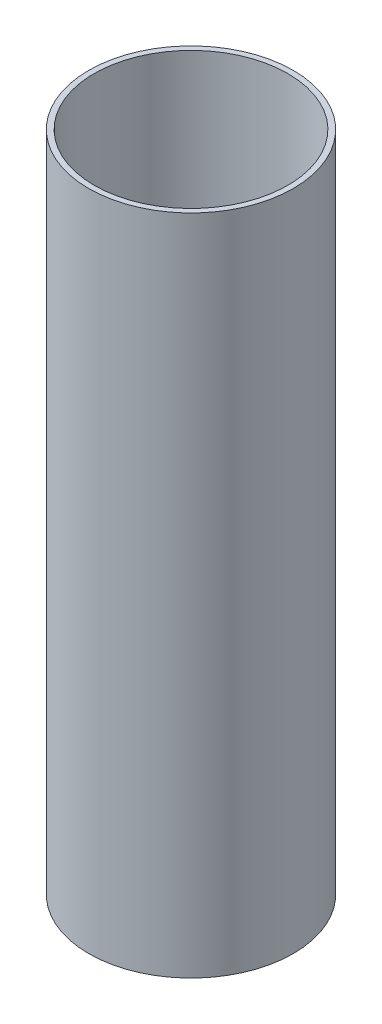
from build123d import *

# Parameters (mm, degrees)
SKETCH1_R           = 28.4353
SKETCH1_R_2         = 26.9113
BOSS_EXTRUDE1_DEPTH = 184.15


with BuildPart() as part:
    # Sketch1 → Boss-Extrude1 (new body)
    with BuildSketch(Plane(origin=(0, 0, 0), x_dir=(1, 0, 0), z_dir=(0, 1, 0))):
        with Locations(Location((0, 0, 0), (0, 0, 270))):
            Circle(SKETCH1_R)
        with Locations(Location((0, 0, 0), (0, 0, 270))):
            Circle(SKETCH1_R_2, mode=Mode.SUBTRACT)
    extrude(amount=BOSS_EXTRUDE1_DEPTH)


solid = part.part
